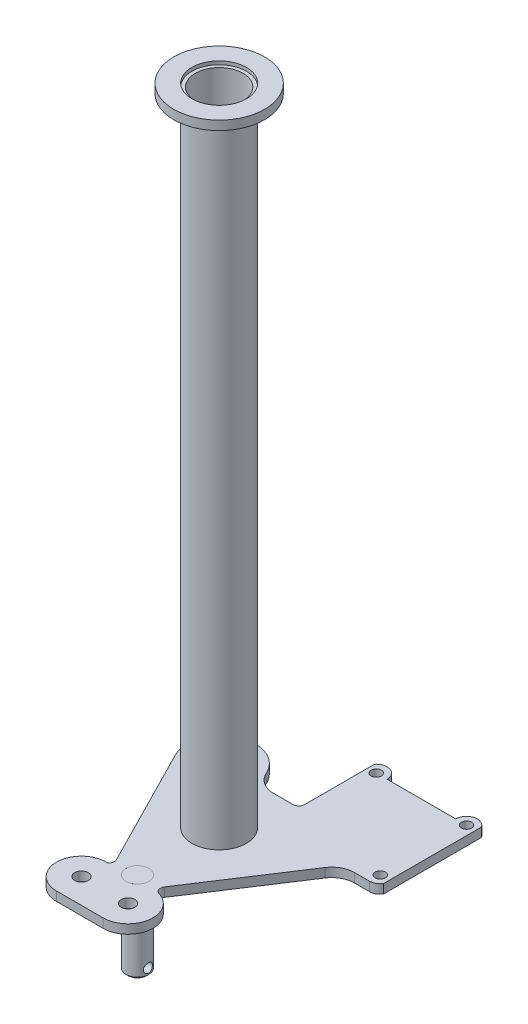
ISO-10303-21;
HEADER;
FILE_DESCRIPTION(('STEP AP214'),'2;1');
FILE_NAME('part.step','',(''),(''),'','','');
FILE_SCHEMA(('AUTOMOTIVE_DESIGN { 1 0 10303 214 1 1 1 1 }'));
ENDSEC;
DATA;
#1=APPLICATION_CONTEXT('core data for automotive mechanical design processes');
#2=APPLICATION_PROTOCOL_DEFINITION('international standard','automotive_design',2000,#1);
#3=PRODUCT_CONTEXT('',#1,'mechanical');
#4=PRODUCT('Part','Part','',(#3));
#5=PRODUCT_RELATED_PRODUCT_CATEGORY('part','',(#4));
#6=PRODUCT_DEFINITION_FORMATION('','',#4);
#7=PRODUCT_DEFINITION_CONTEXT('part definition',#1,'design');
#8=PRODUCT_DEFINITION('design','',#6,#7);
#9=PRODUCT_DEFINITION_SHAPE('','',#8);
#10=(LENGTH_UNIT() NAMED_UNIT(*) SI_UNIT(.MILLI.,.METRE.));
#11=(NAMED_UNIT(*) PLANE_ANGLE_UNIT() SI_UNIT($,.RADIAN.));
#12=(NAMED_UNIT(*) SI_UNIT($,.STERADIAN.) SOLID_ANGLE_UNIT());
#13=UNCERTAINTY_MEASURE_WITH_UNIT(LENGTH_MEASURE(1.E-05),#10,'distance_accuracy_value','');
#14=(GEOMETRIC_REPRESENTATION_CONTEXT(3) GLOBAL_UNCERTAINTY_ASSIGNED_CONTEXT((#13)) GLOBAL_UNIT_ASSIGNED_CONTEXT((#10,
#11,#12)) REPRESENTATION_CONTEXT('',''));
#15=CARTESIAN_POINT('',(0.,0.,0.));
#16=DIRECTION('',(0.,0.,1.));
#17=DIRECTION('',(1.,0.,0.));
#18=AXIS2_PLACEMENT_3D('',#15,#16,#17);
#19=CARTESIAN_POINT('',(0.,576.,0.));
#20=DIRECTION('',(0.,1.,0.));
#21=DIRECTION('',(0.,0.,1.));
#22=AXIS2_PLACEMENT_3D('',#19,#20,#21);
#23=PLANE('',#22);
#24=CARTESIAN_POINT('',(0.,576.,0.));
#25=DIRECTION('',(0.,1.,0.));
#26=DIRECTION('',(0.,0.,1.));
#27=AXIS2_PLACEMENT_3D('',#24,#25,#26);
#28=CIRCLE('',#27,40.);
#29=CARTESIAN_POINT('',(0.,576.,40.));
#30=VERTEX_POINT('',#29);
#31=EDGE_CURVE('E11',#30,#30,#28,.T.);
#32=ORIENTED_EDGE('',*,*,#31,.T.);
#33=EDGE_LOOP('',(#32));
#34=FACE_BOUND('',#33,.T.);
#35=CARTESIAN_POINT('',(0.,576.,0.));
#36=DIRECTION('',(0.,1.,0.));
#37=DIRECTION('',(0.,0.,1.));
#38=AXIS2_PLACEMENT_3D('',#35,#36,#37);
#39=CIRCLE('',#38,24.);
#40=CARTESIAN_POINT('',(0.,576.,24.));
#41=VERTEX_POINT('',#40);
#42=EDGE_CURVE('E52',#41,#41,#39,.T.);
#43=ORIENTED_EDGE('',*,*,#42,.F.);
#44=EDGE_LOOP('',(#43));
#45=FACE_BOUND('',#44,.T.);
#46=ADVANCED_FACE('F41',(#34,#45),#23,.T.);
#47=CARTESIAN_POINT('',(0.,568.,0.));
#48=DIRECTION('',(0.,1.,0.));
#49=DIRECTION('',(0.,0.,1.));
#50=AXIS2_PLACEMENT_3D('',#47,#48,#49);
#51=PLANE('',#50);
#52=CARTESIAN_POINT('',(0.,568.,0.));
#53=DIRECTION('',(0.,1.,0.));
#54=DIRECTION('',(0.,0.,1.));
#55=AXIS2_PLACEMENT_3D('',#52,#53,#54);
#56=CIRCLE('',#55,40.);
#57=CARTESIAN_POINT('',(0.,568.,40.));
#58=VERTEX_POINT('',#57);
#59=EDGE_CURVE('E48',#58,#58,#56,.T.);
#60=ORIENTED_EDGE('',*,*,#59,.F.);
#61=EDGE_LOOP('',(#60));
#62=FACE_BOUND('',#61,.T.);
#63=CARTESIAN_POINT('',(0.,568.,0.));
#64=DIRECTION('',(0.,1.,0.));
#65=DIRECTION('',(0.,0.,1.));
#66=AXIS2_PLACEMENT_3D('',#63,#64,#65);
#67=CIRCLE('',#66,24.);
#68=CARTESIAN_POINT('',(0.,568.,24.));
#69=VERTEX_POINT('',#68);
#70=EDGE_CURVE('E56',#69,#69,#67,.T.);
#71=ORIENTED_EDGE('',*,*,#70,.T.);
#72=EDGE_LOOP('',(#71));
#73=FACE_BOUND('',#72,.T.);
#74=ADVANCED_FACE('F62',(#62,#73),#51,.F.);
#75=CARTESIAN_POINT('',(0.,576.,0.));
#76=DIRECTION('',(0.,-1.,0.));
#77=DIRECTION('',(0.,0.,-1.));
#78=AXIS2_PLACEMENT_3D('',#75,#76,#77);
#79=CYLINDRICAL_SURFACE('',#78,40.);
#80=ORIENTED_EDGE('',*,*,#31,.F.);
#81=EDGE_LOOP('',(#80));
#82=FACE_BOUND('',#81,.T.);
#83=ORIENTED_EDGE('',*,*,#59,.T.);
#84=EDGE_LOOP('',(#83));
#85=FACE_BOUND('',#84,.T.);
#86=ADVANCED_FACE('F43',(#82,#85),#79,.T.);
#87=CARTESIAN_POINT('',(0.,576.,0.));
#88=DIRECTION('',(0.,-1.,0.));
#89=DIRECTION('',(0.,0.,-1.));
#90=AXIS2_PLACEMENT_3D('',#87,#88,#89);
#91=CYLINDRICAL_SURFACE('',#90,24.);
#92=ORIENTED_EDGE('',*,*,#42,.T.);
#93=EDGE_LOOP('',(#92));
#94=FACE_BOUND('',#93,.T.);
#95=ORIENTED_EDGE('',*,*,#70,.F.);
#96=EDGE_LOOP('',(#95));
#97=FACE_BOUND('',#96,.T.);
#98=ADVANCED_FACE('F64',(#94,#97),#91,.F.);
#99=CLOSED_SHELL('',(#46,#74,#86,#98));
#100=MANIFOLD_SOLID_BREP('B2',#99);
#101=CARTESIAN_POINT('',(0.,-65.,72.));
#102=DIRECTION('',(0.,1.,0.));
#103=DIRECTION('',(0.,0.,1.));
#104=AXIS2_PLACEMENT_3D('',#101,#102,#103);
#105=CYLINDRICAL_SURFACE('',#104,10.);
#106=CARTESIAN_POINT('',(-9.16515138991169,-58.,68.));
#107=CARTESIAN_POINT('',(-9.16515220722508,-57.8928225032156,68.0000008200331));
#108=CARTESIAN_POINT('',(-9.16703782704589,-57.7856121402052,68.0043137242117));
#109=CARTESIAN_POINT('',(-9.17451890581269,-57.5719679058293,68.0215219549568));
#110=CARTESIAN_POINT('',(-9.18011663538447,-57.4655345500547,68.034422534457));
#111=CARTESIAN_POINT('',(-9.19485078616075,-57.2540640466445,68.0687064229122));
#112=CARTESIAN_POINT('',(-9.20399425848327,-57.1490301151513,68.0901066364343));
#113=CARTESIAN_POINT('',(-9.22551446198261,-56.9413124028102,68.1411606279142));
#114=CARTESIAN_POINT('',(-9.23789253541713,-56.8386296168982,68.1708178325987));
#115=CARTESIAN_POINT('',(-9.27920231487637,-56.5360102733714,68.2715002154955));
#116=CARTESIAN_POINT('',(-9.31238810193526,-56.3404620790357,68.3544077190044));
#117=CARTESIAN_POINT('',(-9.38629512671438,-55.966198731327,68.5491674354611));
#118=CARTESIAN_POINT('',(-9.42701471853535,-55.7874799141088,68.661013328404));
#119=CARTESIAN_POINT('',(-9.51401677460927,-55.4414881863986,68.917353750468));
#120=CARTESIAN_POINT('',(-9.56047821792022,-55.275289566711,69.0632406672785));
#121=CARTESIAN_POINT('',(-9.65224928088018,-54.9689395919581,69.3805824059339));
#122=CARTESIAN_POINT('',(-9.69755849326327,-54.828797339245,69.5520461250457));
#123=CARTESIAN_POINT('',(-9.78406811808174,-54.5731878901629,69.92398720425));
#124=CARTESIAN_POINT('',(-9.82503606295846,-54.4589115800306,70.1253420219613));
#125=CARTESIAN_POINT('',(-9.89607856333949,-54.266312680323,70.5463494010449));
#126=CARTESIAN_POINT('',(-9.92615755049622,-54.1879754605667,70.7659944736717));
#127=CARTESIAN_POINT('',(-9.97076649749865,-54.073317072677,71.2060671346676));
#128=CARTESIAN_POINT('',(-9.98597873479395,-54.0351453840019,71.4259420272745));
#129=CARTESIAN_POINT('',(-10.001606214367,-53.9959430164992,71.8694673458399));
#130=CARTESIAN_POINT('',(-10.0020269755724,-53.9948984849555,72.0931163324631));
#131=CARTESIAN_POINT('',(-9.98843925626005,-54.0289655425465,72.5244649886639));
#132=CARTESIAN_POINT('',(-9.9752399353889,-54.0620495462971,72.7323549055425));
#133=CARTESIAN_POINT('',(-9.93698582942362,-54.1599857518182,73.1393462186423));
#134=CARTESIAN_POINT('',(-9.91193017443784,-54.2248402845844,73.338446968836));
#135=CARTESIAN_POINT('',(-9.85193648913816,-54.3852729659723,73.7257958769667));
#136=CARTESIAN_POINT('',(-9.81685520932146,-54.4812994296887,73.9138352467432));
#137=CARTESIAN_POINT('',(-9.74029170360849,-54.7009300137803,74.2716163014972));
#138=CARTESIAN_POINT('',(-9.69880728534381,-54.8245435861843,74.44135168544));
#139=CARTESIAN_POINT('',(-9.61043274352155,-55.1052982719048,74.7695376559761));
#140=CARTESIAN_POINT('',(-9.56336653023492,-55.2641077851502,74.9265156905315));
#141=CARTESIAN_POINT('',(-9.47123321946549,-55.6059811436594,75.2122148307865));
#142=CARTESIAN_POINT('',(-9.42616678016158,-55.78905289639,75.3409266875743));
#143=CARTESIAN_POINT('',(-9.34193794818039,-56.1808380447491,75.5698083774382));
#144=CARTESIAN_POINT('',(-9.30297828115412,-56.3901296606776,75.6690693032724));
#145=CARTESIAN_POINT('',(-9.23775180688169,-56.8244309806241,75.830352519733));
#146=CARTESIAN_POINT('',(-9.21147675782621,-57.0494303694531,75.892398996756));
#147=CARTESIAN_POINT('',(-9.1765951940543,-57.494071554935,75.9739098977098));
#148=CARTESIAN_POINT('',(-9.16700732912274,-57.7132008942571,75.9957441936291));
#149=CARTESIAN_POINT('',(-9.16378995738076,-58.1521544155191,76.0031226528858));
#150=CARTESIAN_POINT('',(-9.17015561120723,-58.3719783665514,75.9886778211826));
#151=CARTESIAN_POINT('',(-9.19712088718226,-58.7929178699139,75.9260657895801));
#152=CARTESIAN_POINT('',(-9.21688915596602,-58.9943858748,75.8798661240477));
#153=CARTESIAN_POINT('',(-9.26740102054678,-59.386576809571,75.7576083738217));
#154=CARTESIAN_POINT('',(-9.29814704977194,-59.5772973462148,75.6815436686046));
#155=CARTESIAN_POINT('',(-9.36867563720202,-59.9512047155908,75.4982712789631));
#156=CARTESIAN_POINT('',(-9.40877409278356,-60.1337723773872,75.3899257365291));
#157=CARTESIAN_POINT('',(-9.49300770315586,-60.478965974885,75.1463304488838));
#158=CARTESIAN_POINT('',(-9.53714449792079,-60.6415837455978,75.0110697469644));
#159=CARTESIAN_POINT('',(-9.62841831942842,-60.9547468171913,74.7056884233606));
#160=CARTESIAN_POINT('',(-9.67553614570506,-61.1035131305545,74.5337308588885));
#161=CARTESIAN_POINT('',(-9.76439589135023,-61.3703541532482,74.1661672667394));
#162=CARTESIAN_POINT('',(-9.8061375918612,-61.4884276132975,73.9705602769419));
#163=CARTESIAN_POINT('',(-9.87967431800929,-61.6900952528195,73.5605598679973));
#164=CARTESIAN_POINT('',(-9.9114717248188,-61.7736976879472,73.346170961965));
#165=CARTESIAN_POINT('',(-9.96145426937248,-61.9030977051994,72.9047871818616));
#166=CARTESIAN_POINT('',(-9.97964679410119,-61.9489158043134,72.6777992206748));
#167=CARTESIAN_POINT('',(-9.99958016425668,-61.999009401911,72.233633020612));
#168=CARTESIAN_POINT('',(-10.0023169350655,-62.0058002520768,72.0167809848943));
#169=CARTESIAN_POINT('',(-9.99372084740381,-61.9842890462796,71.5851323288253));
#170=CARTESIAN_POINT('',(-9.98239011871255,-61.9559923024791,71.3703354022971));
#171=CARTESIAN_POINT('',(-9.94743026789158,-61.8669064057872,70.9556581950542));
#172=CARTESIAN_POINT('',(-9.92418961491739,-61.807142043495,70.7555223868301));
#173=CARTESIAN_POINT('',(-9.86789895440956,-61.6578944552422,70.368155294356));
#174=CARTESIAN_POINT('',(-9.83484713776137,-61.568405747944,70.1809263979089));
#175=CARTESIAN_POINT('',(-9.76036189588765,-61.3577933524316,69.8155939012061));
#176=CARTESIAN_POINT('',(-9.71862262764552,-61.2354464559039,69.6382591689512));
#177=CARTESIAN_POINT('',(-9.63178803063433,-60.9644239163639,69.3058920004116));
#178=CARTESIAN_POINT('',(-9.58669131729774,-60.8157373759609,69.150868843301));
#179=CARTESIAN_POINT('',(-9.49475540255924,-60.4853657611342,68.8575972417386));
#180=CARTESIAN_POINT('',(-9.44798115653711,-60.302207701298,68.7209813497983));
#181=CARTESIAN_POINT('',(-9.3609929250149,-59.9141302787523,68.4803059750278));
#182=CARTESIAN_POINT('',(-9.32077971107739,-59.7092083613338,68.3762503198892));
#183=CARTESIAN_POINT('',(-9.2551790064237,-59.3018760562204,68.2120148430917));
#184=CARTESIAN_POINT('',(-9.22878451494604,-59.1008923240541,68.1487343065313));
#185=CARTESIAN_POINT('',(-9.19885565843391,-58.7933610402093,68.0780536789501));
#186=CARTESIAN_POINT('',(-9.19049270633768,-58.6899269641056,68.0585394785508));
#187=CARTESIAN_POINT('',(-9.17721200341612,-58.4816430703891,68.0277114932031));
#188=CARTESIAN_POINT('',(-9.17229225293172,-58.3767941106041,68.0163929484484));
#189=CARTESIAN_POINT('',(-9.16783675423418,-58.2264494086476,68.0061576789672));
#190=CARTESIAN_POINT('',(-9.16683059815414,-58.1812001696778,68.0038494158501));
#191=CARTESIAN_POINT('',(-9.16548771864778,-58.0906359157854,68.0007703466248));
#192=CARTESIAN_POINT('',(-9.16515104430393,-58.0453208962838,67.9999996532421));
#193=CARTESIAN_POINT('',(-9.16515138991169,-58.,68.));
#194=B_SPLINE_CURVE_WITH_KNOTS('',3,(#106,#107,#108,#109,#110,#111,#112,#113,#114,#115,#116,
#117,#118,#119,#120,#121,#122,#123,#124,#125,#126,#127,#128,#129,#130,#131,#132,#133,#134,#135,
#136,#137,#138,#139,#140,#141,#142,#143,#144,#145,#146,#147,#148,#149,#150,#151,#152,#153,#154,
#155,#156,#157,#158,#159,#160,#161,#162,#163,#164,#165,#166,#167,#168,#169,#170,#171,#172,#173,
#174,#175,#176,#177,#178,#179,#180,#181,#182,#183,#184,#185,#186,#187,#188,#189,#190,#191,#192,
#193),.UNSPECIFIED.,.T.,.F.,(4,2,2,2,2,2,2,2,2,2,2,2,2,2,2,2,2,2,2,2,2,2,2,2,2,2,2,2,2,2,2,2,2,
2,2,2,2,2,2,2,2,2,2,4),(0.,0.321486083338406,0.643168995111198,0.965494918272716,
1.28795480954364,1.92974178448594,2.57138871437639,3.24631250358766,3.92147162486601,
4.62325351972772,5.32474947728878,5.99228379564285,6.65956904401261,7.28937303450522,
7.91922324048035,8.55856614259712,9.19812843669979,9.87968101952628,10.5614562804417,
11.2624893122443,11.9630662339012,12.6208430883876,13.278420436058,13.8985450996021,
14.5188073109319,15.1642232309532,15.8099024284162,16.5032748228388,17.1966754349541,
17.8899098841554,18.5827676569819,19.2304209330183,19.8779761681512,20.5056400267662,
21.1334196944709,21.7889411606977,22.4447344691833,23.1411252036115,23.837597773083,
24.4715333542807,24.7879924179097,25.104267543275,25.240200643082,25.3761437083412),.UNSPECIFIED.);
#195=CARTESIAN_POINT('',(-9.16515138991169,-58.,68.));
#196=VERTEX_POINT('',#195);
#197=EDGE_CURVE('E114',#196,#196,#194,.T.);
#198=ORIENTED_EDGE('',*,*,#197,.T.);
#199=EDGE_LOOP('',(#198));
#200=FACE_BOUND('',#199,.T.);
#201=CARTESIAN_POINT('',(9.16515138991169,-58.,68.));
#202=CARTESIAN_POINT('',(9.16515220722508,-58.1071774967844,68.0000008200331));
#203=CARTESIAN_POINT('',(9.16703782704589,-58.2143878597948,68.0043137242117));
#204=CARTESIAN_POINT('',(9.17451890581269,-58.4280320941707,68.0215219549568));
#205=CARTESIAN_POINT('',(9.18011663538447,-58.5344654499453,68.034422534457));
#206=CARTESIAN_POINT('',(9.19485078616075,-58.7459359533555,68.0687064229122));
#207=CARTESIAN_POINT('',(9.20399425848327,-58.8509698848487,68.0901066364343));
#208=CARTESIAN_POINT('',(9.22551446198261,-59.0586875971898,68.1411606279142));
#209=CARTESIAN_POINT('',(9.23789253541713,-59.1613703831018,68.1708178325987));
#210=CARTESIAN_POINT('',(9.27920231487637,-59.4639897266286,68.2715002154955));
#211=CARTESIAN_POINT('',(9.31238810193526,-59.6595379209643,68.3544077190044));
#212=CARTESIAN_POINT('',(9.38629512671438,-60.033801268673,68.5491674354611));
#213=CARTESIAN_POINT('',(9.42701471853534,-60.2125200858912,68.661013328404));
#214=CARTESIAN_POINT('',(9.51401677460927,-60.5585118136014,68.917353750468));
#215=CARTESIAN_POINT('',(9.56047821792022,-60.724710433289,69.0632406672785));
#216=CARTESIAN_POINT('',(9.65224928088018,-61.0310604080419,69.3805824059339));
#217=CARTESIAN_POINT('',(9.69755849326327,-61.171202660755,69.5520461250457));
#218=CARTESIAN_POINT('',(9.78406811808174,-61.4268121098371,69.92398720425));
#219=CARTESIAN_POINT('',(9.82503606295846,-61.5410884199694,70.1253420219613));
#220=CARTESIAN_POINT('',(9.89607856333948,-61.733687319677,70.5463494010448));
#221=CARTESIAN_POINT('',(9.92615755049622,-61.8120245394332,70.7659944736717));
#222=CARTESIAN_POINT('',(9.97076649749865,-61.926682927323,71.2060671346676));
#223=CARTESIAN_POINT('',(9.98597873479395,-61.9648546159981,71.4259420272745));
#224=CARTESIAN_POINT('',(10.001606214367,-62.0040569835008,71.8694673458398));
#225=CARTESIAN_POINT('',(10.0020269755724,-62.0051015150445,72.0931163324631));
#226=CARTESIAN_POINT('',(9.98843925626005,-61.9710344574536,72.5244649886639));
#227=CARTESIAN_POINT('',(9.9752399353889,-61.9379504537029,72.7323549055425));
#228=CARTESIAN_POINT('',(9.93698582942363,-61.8400142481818,73.1393462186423));
#229=CARTESIAN_POINT('',(9.91193017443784,-61.7751597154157,73.338446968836));
#230=CARTESIAN_POINT('',(9.85193648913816,-61.6147270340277,73.7257958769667));
#231=CARTESIAN_POINT('',(9.81685520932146,-61.5187005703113,73.9138352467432));
#232=CARTESIAN_POINT('',(9.74029170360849,-61.2990699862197,74.2716163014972));
#233=CARTESIAN_POINT('',(9.69880728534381,-61.1754564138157,74.4413516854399));
#234=CARTESIAN_POINT('',(9.61043274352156,-60.8947017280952,74.7695376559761));
#235=CARTESIAN_POINT('',(9.56336653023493,-60.7358922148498,74.9265156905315));
#236=CARTESIAN_POINT('',(9.47123321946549,-60.3940188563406,75.2122148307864));
#237=CARTESIAN_POINT('',(9.42616678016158,-60.2109471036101,75.3409266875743));
#238=CARTESIAN_POINT('',(9.34193794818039,-59.8191619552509,75.5698083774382));
#239=CARTESIAN_POINT('',(9.30297828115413,-59.6098703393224,75.6690693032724));
#240=CARTESIAN_POINT('',(9.2377518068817,-59.1755690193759,75.830352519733));
#241=CARTESIAN_POINT('',(9.21147675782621,-58.9505696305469,75.892398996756));
#242=CARTESIAN_POINT('',(9.1765951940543,-58.5059284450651,75.9739098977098));
#243=CARTESIAN_POINT('',(9.16700732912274,-58.2867991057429,75.9957441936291));
#244=CARTESIAN_POINT('',(9.16378995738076,-57.8478455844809,76.0031226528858));
#245=CARTESIAN_POINT('',(9.17015561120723,-57.6280216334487,75.9886778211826));
#246=CARTESIAN_POINT('',(9.19712088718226,-57.2070821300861,75.9260657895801));
#247=CARTESIAN_POINT('',(9.21688915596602,-57.0056141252,75.8798661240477));
#248=CARTESIAN_POINT('',(9.26740102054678,-56.613423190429,75.7576083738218));
#249=CARTESIAN_POINT('',(9.29814704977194,-56.4227026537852,75.6815436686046));
#250=CARTESIAN_POINT('',(9.36867563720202,-56.0487952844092,75.4982712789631));
#251=CARTESIAN_POINT('',(9.40877409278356,-55.8662276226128,75.3899257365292));
#252=CARTESIAN_POINT('',(9.49300770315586,-55.521034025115,75.1463304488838));
#253=CARTESIAN_POINT('',(9.53714449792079,-55.3584162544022,75.0110697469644));
#254=CARTESIAN_POINT('',(9.62841831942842,-55.0452531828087,74.7056884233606));
#255=CARTESIAN_POINT('',(9.67553614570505,-54.8964868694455,74.5337308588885));
#256=CARTESIAN_POINT('',(9.76439589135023,-54.6296458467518,74.1661672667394));
#257=CARTESIAN_POINT('',(9.8061375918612,-54.5115723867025,73.9705602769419));
#258=CARTESIAN_POINT('',(9.87967431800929,-54.3099047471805,73.5605598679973));
#259=CARTESIAN_POINT('',(9.9114717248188,-54.2263023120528,73.346170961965));
#260=CARTESIAN_POINT('',(9.96145426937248,-54.0969022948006,72.9047871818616));
#261=CARTESIAN_POINT('',(9.97964679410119,-54.0510841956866,72.6777992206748));
#262=CARTESIAN_POINT('',(9.99958016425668,-54.000990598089,72.233633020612));
#263=CARTESIAN_POINT('',(10.0023169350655,-53.9941997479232,72.0167809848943));
#264=CARTESIAN_POINT('',(9.99372084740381,-54.0157109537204,71.5851323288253));
#265=CARTESIAN_POINT('',(9.98239011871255,-54.0440076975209,71.3703354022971));
#266=CARTESIAN_POINT('',(9.94743026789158,-54.1330935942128,70.9556581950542));
#267=CARTESIAN_POINT('',(9.92418961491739,-54.192857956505,70.7555223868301));
#268=CARTESIAN_POINT('',(9.86789895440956,-54.3421055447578,70.368155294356));
#269=CARTESIAN_POINT('',(9.83484713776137,-54.431594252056,70.1809263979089));
#270=CARTESIAN_POINT('',(9.76036189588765,-54.6422066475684,69.8155939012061));
#271=CARTESIAN_POINT('',(9.71862262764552,-54.7645535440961,69.6382591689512));
#272=CARTESIAN_POINT('',(9.63178803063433,-55.0355760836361,69.3058920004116));
#273=CARTESIAN_POINT('',(9.58669131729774,-55.1842626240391,69.150868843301));
#274=CARTESIAN_POINT('',(9.49475540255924,-55.5146342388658,68.8575972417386));
#275=CARTESIAN_POINT('',(9.44798115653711,-55.697792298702,68.7209813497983));
#276=CARTESIAN_POINT('',(9.36099292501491,-56.0858697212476,68.4803059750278));
#277=CARTESIAN_POINT('',(9.32077971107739,-56.2907916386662,68.3762503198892));
#278=CARTESIAN_POINT('',(9.2551790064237,-56.6981239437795,68.2120148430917));
#279=CARTESIAN_POINT('',(9.22878451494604,-56.8991076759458,68.1487343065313));
#280=CARTESIAN_POINT('',(9.19885565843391,-57.2066389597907,68.0780536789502));
#281=CARTESIAN_POINT('',(9.19049270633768,-57.3100730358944,68.0585394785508));
#282=CARTESIAN_POINT('',(9.17721200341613,-57.5183569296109,68.0277114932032));
#283=CARTESIAN_POINT('',(9.17229225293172,-57.6232058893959,68.0163929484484));
#284=CARTESIAN_POINT('',(9.16783675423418,-57.7735505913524,68.0061576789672));
#285=CARTESIAN_POINT('',(9.16683059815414,-57.8187998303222,68.0038494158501));
#286=CARTESIAN_POINT('',(9.16548771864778,-57.9093640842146,68.0007703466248));
#287=CARTESIAN_POINT('',(9.16515104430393,-57.9546791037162,67.9999996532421));
#288=CARTESIAN_POINT('',(9.16515138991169,-58.,68.));
#289=B_SPLINE_CURVE_WITH_KNOTS('',3,(#201,#202,#203,#204,#205,#206,#207,#208,#209,#210,#211,
#212,#213,#214,#215,#216,#217,#218,#219,#220,#221,#222,#223,#224,#225,#226,#227,#228,#229,#230,
#231,#232,#233,#234,#235,#236,#237,#238,#239,#240,#241,#242,#243,#244,#245,#246,#247,#248,#249,
#250,#251,#252,#253,#254,#255,#256,#257,#258,#259,#260,#261,#262,#263,#264,#265,#266,#267,#268,
#269,#270,#271,#272,#273,#274,#275,#276,#277,#278,#279,#280,#281,#282,#283,#284,#285,#286,#287,
#288),.UNSPECIFIED.,.T.,.F.,(4,2,2,2,2,2,2,2,2,2,2,2,2,2,2,2,2,2,2,2,2,2,2,2,2,2,2,2,2,2,2,2,2,
2,2,2,2,2,2,2,2,2,2,4),(0.,0.321486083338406,0.643168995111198,0.965494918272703,
1.28795480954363,1.92974178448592,2.57138871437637,3.24631250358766,3.921471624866,
4.62325351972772,5.32474947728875,5.99228379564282,6.6595690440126,7.28937303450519,
7.91922324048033,8.55856614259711,9.19812843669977,9.87968101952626,10.5614562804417,
11.2624893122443,11.9630662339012,12.6208430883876,13.278420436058,13.8985450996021,
14.5188073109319,15.1642232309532,15.8099024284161,16.5032748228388,17.1966754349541,
17.8899098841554,18.5827676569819,19.2304209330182,19.8779761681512,20.5056400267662,
21.1334196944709,21.7889411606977,22.4447344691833,23.1411252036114,23.8375977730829,
24.4715333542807,24.7879924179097,25.1042675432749,25.240200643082,25.3761437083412),.UNSPECIFIED.);
#290=CARTESIAN_POINT('',(9.16515138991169,-58.,68.));
#291=VERTEX_POINT('',#290);
#292=EDGE_CURVE('E129',#291,#291,#289,.T.);
#293=ORIENTED_EDGE('',*,*,#292,.T.);
#294=EDGE_LOOP('',(#293));
#295=FACE_BOUND('',#294,.T.);
#296=CARTESIAN_POINT('',(0.,-63.,72.));
#297=DIRECTION('',(0.,-1.,0.));
#298=DIRECTION('',(0.,0.,-1.));
#299=AXIS2_PLACEMENT_3D('',#296,#297,#298);
#300=CIRCLE('',#299,10.);
#301=CARTESIAN_POINT('',(0.,-63.,62.));
#302=VERTEX_POINT('',#301);
#303=EDGE_CURVE('E40',#302,#302,#300,.F.);
#304=ORIENTED_EDGE('',*,*,#303,.T.);
#305=EDGE_LOOP('',(#304));
#306=FACE_BOUND('',#305,.T.);
#307=CARTESIAN_POINT('',(0.,8.,72.));
#308=DIRECTION('',(0.,-1.,0.));
#309=DIRECTION('',(0.,0.,-1.));
#310=AXIS2_PLACEMENT_3D('',#307,#308,#309);
#311=CIRCLE('',#310,10.);
#312=CARTESIAN_POINT('',(0.,8.,62.));
#313=VERTEX_POINT('',#312);
#314=EDGE_CURVE('E126',#313,#313,#311,.T.);
#315=ORIENTED_EDGE('',*,*,#314,.T.);
#316=EDGE_LOOP('',(#315));
#317=FACE_BOUND('',#316,.T.);
#318=ADVANCED_FACE('F110',(#200,#295,#306,#317),#105,.T.);
#319=CARTESIAN_POINT('',(0.,-65.,72.));
#320=DIRECTION('',(0.,-1.,0.));
#321=DIRECTION('',(0.,0.,-1.));
#322=AXIS2_PLACEMENT_3D('',#319,#320,#321);
#323=PLANE('',#322);
#324=CARTESIAN_POINT('',(0.,-65.,72.));
#325=DIRECTION('',(0.,-1.,0.));
#326=DIRECTION('',(0.,0.,-1.));
#327=AXIS2_PLACEMENT_3D('',#324,#325,#326);
#328=CIRCLE('',#327,7.99999999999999);
#329=CARTESIAN_POINT('',(0.,-65.,64.));
#330=VERTEX_POINT('',#329);
#331=EDGE_CURVE('E121',#330,#330,#328,.T.);
#332=ORIENTED_EDGE('',*,*,#331,.T.);
#333=EDGE_LOOP('',(#332));
#334=FACE_BOUND('',#333,.T.);
#335=ADVANCED_FACE('F145',(#334),#323,.T.);
#336=CARTESIAN_POINT('',(0.,8.,72.));
#337=DIRECTION('',(0.,-1.,0.));
#338=DIRECTION('',(0.,0.,-1.));
#339=AXIS2_PLACEMENT_3D('',#336,#337,#338);
#340=PLANE('',#339);
#341=ORIENTED_EDGE('',*,*,#314,.F.);
#342=EDGE_LOOP('',(#341));
#343=FACE_BOUND('',#342,.T.);
#344=ADVANCED_FACE('F142',(#343),#340,.F.);
#345=CARTESIAN_POINT('',(0.,-65.,72.));
#346=DIRECTION('',(0.,1.,0.));
#347=DIRECTION('',(0.,0.,1.));
#348=AXIS2_PLACEMENT_3D('',#345,#346,#347);
#349=CONICAL_SURFACE('',#348,7.99999999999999,0.785398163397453);
#350=ORIENTED_EDGE('',*,*,#303,.F.);
#351=EDGE_LOOP('',(#350));
#352=FACE_BOUND('',#351,.T.);
#353=ORIENTED_EDGE('',*,*,#331,.F.);
#354=EDGE_LOOP('',(#353));
#355=FACE_BOUND('',#354,.T.);
#356=ADVANCED_FACE('F137',(#352,#355),#349,.T.);
#357=CARTESIAN_POINT('',(-78.1,-58.,72.));
#358=DIRECTION('',(1.,0.,0.));
#359=DIRECTION('',(0.,0.,-1.));
#360=AXIS2_PLACEMENT_3D('',#357,#358,#359);
#361=CYLINDRICAL_SURFACE('',#360,4.00000000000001);
#362=ORIENTED_EDGE('',*,*,#292,.F.);
#363=EDGE_LOOP('',(#362));
#364=FACE_BOUND('',#363,.T.);
#365=ORIENTED_EDGE('',*,*,#197,.F.);
#366=EDGE_LOOP('',(#365));
#367=FACE_BOUND('',#366,.T.);
#368=ADVANCED_FACE('F133',(#364,#367),#361,.F.);
#369=CLOSED_SHELL('',(#318,#335,#344,#356,#368));
#370=MANIFOLD_SOLID_BREP('B6',#369);
#371=CARTESIAN_POINT('',(0.,573.,0.));
#372=DIRECTION('',(0.,-1.,0.));
#373=DIRECTION('',(0.,0.,-1.));
#374=AXIS2_PLACEMENT_3D('',#371,#372,#373);
#375=CYLINDRICAL_SURFACE('',#374,21.);
#376=CARTESIAN_POINT('',(0.,573.,0.));
#377=DIRECTION('',(0.,1.,0.));
#378=DIRECTION('',(0.,0.,1.));
#379=AXIS2_PLACEMENT_3D('',#376,#377,#378);
#380=CIRCLE('',#379,21.);
#381=CARTESIAN_POINT('',(0.,573.,21.));
#382=VERTEX_POINT('',#381);
#383=EDGE_CURVE('E215',#382,#382,#380,.T.);
#384=ORIENTED_EDGE('',*,*,#383,.T.);
#385=EDGE_LOOP('',(#384));
#386=FACE_BOUND('',#385,.T.);
#387=CARTESIAN_POINT('',(0.,-5.,0.));
#388=DIRECTION('',(0.,1.,0.));
#389=DIRECTION('',(0.,0.,1.));
#390=AXIS2_PLACEMENT_3D('',#387,#388,#389);
#391=CIRCLE('',#390,21.);
#392=CARTESIAN_POINT('',(0.,-5.,21.));
#393=VERTEX_POINT('',#392);
#394=EDGE_CURVE('E223',#393,#393,#391,.T.);
#395=ORIENTED_EDGE('',*,*,#394,.F.);
#396=EDGE_LOOP('',(#395));
#397=FACE_BOUND('',#396,.T.);
#398=ADVANCED_FACE('F209',(#386,#397),#375,.F.);
#399=CARTESIAN_POINT('',(0.,573.,0.));
#400=DIRECTION('',(0.,-1.,0.));
#401=DIRECTION('',(0.,0.,-1.));
#402=AXIS2_PLACEMENT_3D('',#399,#400,#401);
#403=CYLINDRICAL_SURFACE('',#402,24.);
#404=CARTESIAN_POINT('',(0.,573.,0.));
#405=DIRECTION('',(0.,1.,0.));
#406=DIRECTION('',(0.,0.,1.));
#407=AXIS2_PLACEMENT_3D('',#404,#405,#406);
#408=CIRCLE('',#407,24.);
#409=CARTESIAN_POINT('',(0.,573.,24.));
#410=VERTEX_POINT('',#409);
#411=EDGE_CURVE('E109',#410,#410,#408,.T.);
#412=ORIENTED_EDGE('',*,*,#411,.F.);
#413=EDGE_LOOP('',(#412));
#414=FACE_BOUND('',#413,.T.);
#415=CARTESIAN_POINT('',(0.,-5.,0.));
#416=DIRECTION('',(0.,1.,0.));
#417=DIRECTION('',(0.,0.,1.));
#418=AXIS2_PLACEMENT_3D('',#415,#416,#417);
#419=CIRCLE('',#418,24.);
#420=CARTESIAN_POINT('',(0.,-5.,24.));
#421=VERTEX_POINT('',#420);
#422=EDGE_CURVE('E219',#421,#421,#419,.T.);
#423=ORIENTED_EDGE('',*,*,#422,.T.);
#424=EDGE_LOOP('',(#423));
#425=FACE_BOUND('',#424,.T.);
#426=ADVANCED_FACE('F233',(#414,#425),#403,.T.);
#427=CARTESIAN_POINT('',(0.,573.,0.));
#428=DIRECTION('',(0.,1.,0.));
#429=DIRECTION('',(0.,0.,1.));
#430=AXIS2_PLACEMENT_3D('',#427,#428,#429);
#431=PLANE('',#430);
#432=ORIENTED_EDGE('',*,*,#383,.F.);
#433=EDGE_LOOP('',(#432));
#434=FACE_BOUND('',#433,.T.);
#435=ORIENTED_EDGE('',*,*,#411,.T.);
#436=EDGE_LOOP('',(#435));
#437=FACE_BOUND('',#436,.T.);
#438=ADVANCED_FACE('F237',(#434,#437),#431,.T.);
#439=CARTESIAN_POINT('',(0.,-5.,0.));
#440=DIRECTION('',(0.,1.,0.));
#441=DIRECTION('',(0.,0.,1.));
#442=AXIS2_PLACEMENT_3D('',#439,#440,#441);
#443=PLANE('',#442);
#444=ORIENTED_EDGE('',*,*,#394,.T.);
#445=EDGE_LOOP('',(#444));
#446=FACE_BOUND('',#445,.T.);
#447=ORIENTED_EDGE('',*,*,#422,.F.);
#448=EDGE_LOOP('',(#447));
#449=FACE_BOUND('',#448,.T.);
#450=ADVANCED_FACE('F229',(#446,#449),#443,.F.);
#451=CLOSED_SHELL('',(#398,#426,#438,#450));
#452=MANIFOLD_SOLID_BREP('B35',#451);
#453=CARTESIAN_POINT('',(-25.25,8.,72.));
#454=DIRECTION('',(0.,1.,0.));
#455=DIRECTION('',(0.,0.,1.));
#456=AXIS2_PLACEMENT_3D('',#453,#454,#455);
#457=PLANE('',#456);
#458=CARTESIAN_POINT('',(107.,8.,-34.9));
#459=DIRECTION('',(0.,1.,0.));
#460=DIRECTION('',(0.,0.,1.));
#461=AXIS2_PLACEMENT_3D('',#458,#459,#460);
#462=CIRCLE('',#461,4.50000000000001);
#463=CARTESIAN_POINT('',(107.,8.,-30.4));
#464=VERTEX_POINT('',#463);
#465=EDGE_CURVE('E694',#464,#464,#462,.T.);
#466=ORIENTED_EDGE('',*,*,#465,.F.);
#467=EDGE_LOOP('',(#466));
#468=FACE_BOUND('',#467,.T.);
#469=CARTESIAN_POINT('',(17.6217629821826,8.,97.9));
#470=DIRECTION('',(0.,1.,0.));
#471=DIRECTION('',(0.,0.,1.));
#472=AXIS2_PLACEMENT_3D('',#469,#470,#471);
#473=CIRCLE('',#472,6.00000000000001);
#474=CARTESIAN_POINT('',(17.6217629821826,8.,103.9));
#475=VERTEX_POINT('',#474);
#476=EDGE_CURVE('E706',#475,#475,#473,.T.);
#477=ORIENTED_EDGE('',*,*,#476,.F.);
#478=EDGE_LOOP('',(#477));
#479=FACE_BOUND('',#478,.T.);
#480=CARTESIAN_POINT('',(0.,8.,72.));
#481=DIRECTION('',(0.,1.,0.));
#482=DIRECTION('',(0.,0.,1.));
#483=AXIS2_PLACEMENT_3D('',#480,#481,#482);
#484=CIRCLE('',#483,10.);
#485=CARTESIAN_POINT('',(0.,8.,82.));
#486=VERTEX_POINT('',#485);
#487=EDGE_CURVE('E718',#486,#486,#484,.T.);
#488=ORIENTED_EDGE('',*,*,#487,.F.);
#489=EDGE_LOOP('',(#488));
#490=FACE_BOUND('',#489,.T.);
#491=CARTESIAN_POINT('',(0.,8.,0.));
#492=DIRECTION('',(0.,1.,0.));
#493=DIRECTION('',(0.,0.,1.));
#494=AXIS2_PLACEMENT_3D('',#491,#492,#493);
#495=CIRCLE('',#494,24.);
#496=CARTESIAN_POINT('',(0.,8.,24.));
#497=VERTEX_POINT('',#496);
#498=EDGE_CURVE('E428',#497,#497,#495,.T.);
#499=ORIENTED_EDGE('',*,*,#498,.F.);
#500=EDGE_LOOP('',(#499));
#501=FACE_BOUND('',#500,.T.);
#502=CARTESIAN_POINT('',(-25.25,8.,72.));
#503=DIRECTION('',(0.,-1.,0.));
#504=DIRECTION('',(0.,0.,1.));
#505=AXIS2_PLACEMENT_3D('',#502,#503,#504);
#506=CIRCLE('',#505,5.);
#507=CARTESIAN_POINT('',(-20.7953119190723,8.,69.7293714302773));
#508=VERTEX_POINT('',#507);
#509=CARTESIAN_POINT('',(-22.1634076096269,8.,75.9335667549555));
#510=VERTEX_POINT('',#509);
#511=EDGE_CURVE('E468',#508,#510,#506,.T.);
#512=ORIENTED_EDGE('',*,*,#511,.T.);
#513=CARTESIAN_POINT('',(-23.3782370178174,8.,97.9));
#514=DIRECTION('',(0.,1.,0.));
#515=DIRECTION('',(0.,0.,-1.));
#516=AXIS2_PLACEMENT_3D('',#513,#514,#515);
#517=CIRCLE('',#516,22.);
#518=CARTESIAN_POINT('',(-23.3782370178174,8.,119.9));
#519=VERTEX_POINT('',#518);
#520=EDGE_CURVE('E423',#510,#519,#517,.T.);
#521=ORIENTED_EDGE('',*,*,#520,.T.);
#522=DIRECTION('',(1.,0.,0.));
#523=VECTOR('',#522,1.);
#524=CARTESIAN_POINT('',(17.6217629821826,8.,119.9));
#525=LINE('',#524,#523);
#526=CARTESIAN_POINT('',(17.6217629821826,8.,119.9));
#527=VERTEX_POINT('',#526);
#528=EDGE_CURVE('E471',#519,#527,#525,.T.);
#529=ORIENTED_EDGE('',*,*,#528,.T.);
#530=CARTESIAN_POINT('',(17.6217629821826,8.,97.9));
#531=DIRECTION('',(0.,1.,0.));
#532=DIRECTION('',(0.,0.,-1.));
#533=AXIS2_PLACEMENT_3D('',#530,#531,#532);
#534=CIRCLE('',#533,22.);
#535=CARTESIAN_POINT('',(23.837363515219,8.,76.7962962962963));
#536=VERTEX_POINT('',#535);
#537=EDGE_CURVE('E473',#527,#536,#534,.T.);
#538=ORIENTED_EDGE('',*,*,#537,.T.);
#539=CARTESIAN_POINT('',(25.25,8.,72.));
#540=DIRECTION('',(0.,-1.,0.));
#541=DIRECTION('',(0.,0.,1.));
#542=AXIS2_PLACEMENT_3D('',#539,#540,#541);
#543=CIRCLE('',#542,5.);
#544=CARTESIAN_POINT('',(21.0656809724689,8.,69.2629442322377));
#545=VERTEX_POINT('',#544);
#546=EDGE_CURVE('E475',#536,#545,#543,.T.);
#547=ORIENTED_EDGE('',*,*,#546,.T.);
#548=DIRECTION('',(0.547411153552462,0.,-0.836863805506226));
#549=VECTOR('',#548,1.);
#550=CARTESIAN_POINT('',(77.0658419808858,8.,-16.3482230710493));
#551=LINE('',#550,#549);
#552=CARTESIAN_POINT('',(77.0658419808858,8.,-16.3482230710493));
#553=VERTEX_POINT('',#552);
#554=EDGE_CURVE('E477',#545,#553,#551,.T.);
#555=ORIENTED_EDGE('',*,*,#554,.T.);
#556=CARTESIAN_POINT('',(93.8031180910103,8.,-5.40000000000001));
#557=DIRECTION('',(0.,-1.,0.));
#558=DIRECTION('',(0.,0.,1.));
#559=AXIS2_PLACEMENT_3D('',#556,#557,#558);
#560=CIRCLE('',#559,20.);
#561=CARTESIAN_POINT('',(93.8031180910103,8.,-25.4));
#562=VERTEX_POINT('',#561);
#563=EDGE_CURVE('E479',#553,#562,#560,.T.);
#564=ORIENTED_EDGE('',*,*,#563,.T.);
#565=DIRECTION('',(1.,0.,0.));
#566=VECTOR('',#565,1.);
#567=CARTESIAN_POINT('',(107.,8.,-25.4));
#568=LINE('',#567,#566);
#569=CARTESIAN_POINT('',(107.,8.,-25.4));
#570=VERTEX_POINT('',#569);
#571=EDGE_CURVE('E481',#562,#570,#568,.T.);
#572=ORIENTED_EDGE('',*,*,#571,.T.);
#573=CARTESIAN_POINT('',(107.,8.,-34.9));
#574=DIRECTION('',(0.,1.,0.));
#575=DIRECTION('',(0.,0.,-1.));
#576=AXIS2_PLACEMENT_3D('',#573,#574,#575);
#577=CIRCLE('',#576,9.5);
#578=CARTESIAN_POINT('',(115.,8.,-29.7765246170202));
#579=VERTEX_POINT('',#578);
#580=EDGE_CURVE('E483',#570,#579,#577,.T.);
#581=ORIENTED_EDGE('',*,*,#580,.T.);
#582=DIRECTION('',(0.,0.,-1.));
#583=VECTOR('',#582,1.);
#584=CARTESIAN_POINT('',(115.,8.,-116.02347538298));
#585=LINE('',#584,#583);
#586=CARTESIAN_POINT('',(115.,8.,-116.02347538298));
#587=VERTEX_POINT('',#586);
#588=EDGE_CURVE('E485',#579,#587,#585,.T.);
#589=ORIENTED_EDGE('',*,*,#588,.T.);
#590=CARTESIAN_POINT('',(107.,8.,-110.9));
#591=DIRECTION('',(0.,1.,0.));
#592=DIRECTION('',(0.,0.,-1.));
#593=AXIS2_PLACEMENT_3D('',#590,#591,#592);
#594=CIRCLE('',#593,9.5);
#595=CARTESIAN_POINT('',(97.5,8.,-110.9));
#596=VERTEX_POINT('',#595);
#597=EDGE_CURVE('E487',#587,#596,#594,.T.);
#598=ORIENTED_EDGE('',*,*,#597,.T.);
#599=DIRECTION('',(-1.,0.,0.));
#600=VECTOR('',#599,1.);
#601=CARTESIAN_POINT('',(37.,8.,-110.9));
#602=LINE('',#601,#600);
#603=CARTESIAN_POINT('',(37.,8.,-110.9));
#604=VERTEX_POINT('',#603);
#605=EDGE_CURVE('E489',#596,#604,#602,.T.);
#606=ORIENTED_EDGE('',*,*,#605,.T.);
#607=CARTESIAN_POINT('',(27.5,8.,-110.9));
#608=DIRECTION('',(0.,1.,0.));
#609=DIRECTION('',(0.,0.,-1.));
#610=AXIS2_PLACEMENT_3D('',#607,#608,#609);
#611=CIRCLE('',#610,9.5);
#612=CARTESIAN_POINT('',(20.,8.,-116.730951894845));
#613=VERTEX_POINT('',#612);
#614=EDGE_CURVE('E491',#604,#613,#611,.T.);
#615=ORIENTED_EDGE('',*,*,#614,.T.);
#616=DIRECTION('',(0.,0.,1.));
#617=VECTOR('',#616,1.);
#618=CARTESIAN_POINT('',(20.,8.,-55.1857092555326));
#619=LINE('',#618,#617);
#620=CARTESIAN_POINT('',(20.,8.,-55.1857092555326));
#621=VERTEX_POINT('',#620);
#622=EDGE_CURVE('E493',#613,#621,#619,.T.);
#623=ORIENTED_EDGE('',*,*,#622,.T.);
#624=CARTESIAN_POINT('',(15.,8.,-55.1857092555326));
#625=DIRECTION('',(0.,-1.,0.));
#626=DIRECTION('',(0.,0.,1.));
#627=AXIS2_PLACEMENT_3D('',#624,#625,#626);
#628=CIRCLE('',#627,5.);
#629=CARTESIAN_POINT('',(15.,8.,-50.1857092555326));
#630=VERTEX_POINT('',#629);
#631=EDGE_CURVE('E495',#621,#630,#628,.T.);
#632=ORIENTED_EDGE('',*,*,#631,.T.);
#633=DIRECTION('',(-1.,0.,0.));
#634=VECTOR('',#633,1.);
#635=CARTESIAN_POINT('',(-2.4,8.,-50.1857092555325));
#636=LINE('',#635,#634);
#637=CARTESIAN_POINT('',(-2.39999999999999,8.,-50.1857092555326));
#638=VERTEX_POINT('',#637);
#639=EDGE_CURVE('E497',#630,#638,#636,.T.);
#640=ORIENTED_EDGE('',*,*,#639,.T.);
#641=CARTESIAN_POINT('',(-2.4,8.,-70.1857092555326));
#642=DIRECTION('',(0.,-1.,0.));
#643=DIRECTION('',(0.,0.,-1.));
#644=AXIS2_PLACEMENT_3D('',#641,#642,#643);
#645=CIRCLE('',#644,20.);
#646=CARTESIAN_POINT('',(-20.68,8.,-62.0714255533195));
#647=VERTEX_POINT('',#646);
#648=EDGE_CURVE('E499',#638,#647,#645,.T.);
#649=ORIENTED_EDGE('',*,*,#648,.T.);
#650=CARTESIAN_POINT('',(-48.1,8.,-49.9));
#651=DIRECTION('',(0.,1.,0.));
#652=DIRECTION('',(0.,0.,-1.));
#653=AXIS2_PLACEMENT_3D('',#650,#651,#652);
#654=CIRCLE('',#653,30.);
#655=CARTESIAN_POINT('',(-74.828128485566,8.,-36.2762285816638));
#656=VERTEX_POINT('',#655);
#657=EDGE_CURVE('E298',#647,#656,#654,.T.);
#658=ORIENTED_EDGE('',*,*,#657,.T.);
#659=DIRECTION('',(0.45412571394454,0.,0.890937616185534));
#660=VECTOR('',#659,1.);
#661=CARTESIAN_POINT('',(-20.7953119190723,8.,69.7293714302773));
#662=LINE('',#661,#660);
#663=EDGE_CURVE('E293',#656,#508,#662,.T.);
#664=ORIENTED_EDGE('',*,*,#663,.T.);
#665=EDGE_LOOP('',(#512,#521,#529,#538,#547,#555,#564,#572,#581,#589,#598,#606,#615,#623,#632,
#640,#649,#658,#664));
#666=FACE_BOUND('',#665,.T.);
#667=CARTESIAN_POINT('',(-48.1,8.,-49.9));
#668=DIRECTION('',(0.,1.,0.));
#669=DIRECTION('',(0.,0.,1.));
#670=AXIS2_PLACEMENT_3D('',#667,#668,#669);
#671=CIRCLE('',#670,19.);
#672=CARTESIAN_POINT('',(-48.1,8.,-30.9));
#673=VERTEX_POINT('',#672);
#674=EDGE_CURVE('E724',#673,#673,#671,.T.);
#675=ORIENTED_EDGE('',*,*,#674,.F.);
#676=EDGE_LOOP('',(#675));
#677=FACE_BOUND('',#676,.T.);
#678=CARTESIAN_POINT('',(-23.3782370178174,8.,97.9));
#679=DIRECTION('',(0.,1.,0.));
#680=DIRECTION('',(0.,0.,1.));
#681=AXIS2_PLACEMENT_3D('',#678,#679,#680);
#682=CIRCLE('',#681,6.00000000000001);
#683=CARTESIAN_POINT('',(-23.3782370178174,8.,103.9));
#684=VERTEX_POINT('',#683);
#685=EDGE_CURVE('E712',#684,#684,#682,.T.);
#686=ORIENTED_EDGE('',*,*,#685,.F.);
#687=EDGE_LOOP('',(#686));
#688=FACE_BOUND('',#687,.T.);
#689=CARTESIAN_POINT('',(107.,8.,-110.9));
#690=DIRECTION('',(0.,1.,0.));
#691=DIRECTION('',(0.,0.,1.));
#692=AXIS2_PLACEMENT_3D('',#689,#690,#691);
#693=CIRCLE('',#692,4.50000000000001);
#694=CARTESIAN_POINT('',(107.,8.,-106.4));
#695=VERTEX_POINT('',#694);
#696=EDGE_CURVE('E700',#695,#695,#693,.T.);
#697=ORIENTED_EDGE('',*,*,#696,.F.);
#698=EDGE_LOOP('',(#697));
#699=FACE_BOUND('',#698,.T.);
#700=CARTESIAN_POINT('',(27.5,8.,-110.9));
#701=DIRECTION('',(0.,1.,0.));
#702=DIRECTION('',(0.,0.,1.));
#703=AXIS2_PLACEMENT_3D('',#700,#701,#702);
#704=CIRCLE('',#703,4.50000000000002);
#705=CARTESIAN_POINT('',(27.5,8.,-106.4));
#706=VERTEX_POINT('',#705);
#707=EDGE_CURVE('E683',#706,#706,#704,.T.);
#708=ORIENTED_EDGE('',*,*,#707,.F.);
#709=EDGE_LOOP('',(#708));
#710=FACE_BOUND('',#709,.T.);
#711=ADVANCED_FACE('F278',(#468,#479,#490,#501,#666,#677,#688,#699,#710),#457,.T.);
#712=CARTESIAN_POINT('',(-25.25,0.,72.));
#713=DIRECTION('',(0.,1.,0.));
#714=DIRECTION('',(0.,0.,1.));
#715=AXIS2_PLACEMENT_3D('',#712,#713,#714);
#716=PLANE('',#715);
#717=CARTESIAN_POINT('',(107.,0.,-34.9));
#718=DIRECTION('',(0.,1.,0.));
#719=DIRECTION('',(0.,0.,1.));
#720=AXIS2_PLACEMENT_3D('',#717,#718,#719);
#721=CIRCLE('',#720,4.50000000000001);
#722=CARTESIAN_POINT('',(107.,0.,-30.4));
#723=VERTEX_POINT('',#722);
#724=EDGE_CURVE('E689',#723,#723,#721,.T.);
#725=ORIENTED_EDGE('',*,*,#724,.T.);
#726=EDGE_LOOP('',(#725));
#727=FACE_BOUND('',#726,.T.);
#728=CARTESIAN_POINT('',(17.6217629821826,0.,97.9));
#729=DIRECTION('',(0.,1.,0.));
#730=DIRECTION('',(0.,0.,1.));
#731=AXIS2_PLACEMENT_3D('',#728,#729,#730);
#732=CIRCLE('',#731,6.00000000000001);
#733=CARTESIAN_POINT('',(17.6217629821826,0.,103.9));
#734=VERTEX_POINT('',#733);
#735=EDGE_CURVE('E703',#734,#734,#732,.T.);
#736=ORIENTED_EDGE('',*,*,#735,.T.);
#737=EDGE_LOOP('',(#736));
#738=FACE_BOUND('',#737,.T.);
#739=CARTESIAN_POINT('',(0.,0.,72.));
#740=DIRECTION('',(0.,1.,0.));
#741=DIRECTION('',(0.,0.,1.));
#742=AXIS2_PLACEMENT_3D('',#739,#740,#741);
#743=CIRCLE('',#742,10.);
#744=CARTESIAN_POINT('',(0.,0.,82.));
#745=VERTEX_POINT('',#744);
#746=EDGE_CURVE('E715',#745,#745,#743,.T.);
#747=ORIENTED_EDGE('',*,*,#746,.T.);
#748=EDGE_LOOP('',(#747));
#749=FACE_BOUND('',#748,.T.);
#750=CARTESIAN_POINT('',(0.,0.,0.));
#751=DIRECTION('',(0.,1.,0.));
#752=DIRECTION('',(0.,0.,1.));
#753=AXIS2_PLACEMENT_3D('',#750,#751,#752);
#754=CIRCLE('',#753,24.);
#755=CARTESIAN_POINT('',(0.,0.,24.));
#756=VERTEX_POINT('',#755);
#757=EDGE_CURVE('E431',#756,#756,#754,.T.);
#758=ORIENTED_EDGE('',*,*,#757,.T.);
#759=EDGE_LOOP('',(#758));
#760=FACE_BOUND('',#759,.T.);
#761=CARTESIAN_POINT('',(-25.25,0.,72.));
#762=DIRECTION('',(0.,-1.,0.));
#763=DIRECTION('',(0.,0.,1.));
#764=AXIS2_PLACEMENT_3D('',#761,#762,#763);
#765=CIRCLE('',#764,5.);
#766=CARTESIAN_POINT('',(-20.7953119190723,0.,69.7293714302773));
#767=VERTEX_POINT('',#766);
#768=CARTESIAN_POINT('',(-22.1634076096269,0.,75.9335667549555));
#769=VERTEX_POINT('',#768);
#770=EDGE_CURVE('E414',#767,#769,#765,.T.);
#771=ORIENTED_EDGE('',*,*,#770,.F.);
#772=DIRECTION('',(0.45412571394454,0.,0.890937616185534));
#773=VECTOR('',#772,1.);
#774=CARTESIAN_POINT('',(-20.7953119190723,0.,69.7293714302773));
#775=LINE('',#774,#773);
#776=CARTESIAN_POINT('',(-74.828128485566,0.,-36.2762285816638));
#777=VERTEX_POINT('',#776);
#778=EDGE_CURVE('E466',#777,#767,#775,.T.);
#779=ORIENTED_EDGE('',*,*,#778,.F.);
#780=CARTESIAN_POINT('',(-48.1,0.,-49.9));
#781=DIRECTION('',(0.,1.,0.));
#782=DIRECTION('',(0.,0.,-1.));
#783=AXIS2_PLACEMENT_3D('',#780,#781,#782);
#784=CIRCLE('',#783,30.);
#785=CARTESIAN_POINT('',(-20.68,0.,-62.0714255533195));
#786=VERTEX_POINT('',#785);
#787=EDGE_CURVE('E464',#786,#777,#784,.T.);
#788=ORIENTED_EDGE('',*,*,#787,.F.);
#789=CARTESIAN_POINT('',(-2.4,0.,-70.1857092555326));
#790=DIRECTION('',(0.,-1.,0.));
#791=DIRECTION('',(0.,0.,-1.));
#792=AXIS2_PLACEMENT_3D('',#789,#790,#791);
#793=CIRCLE('',#792,20.);
#794=CARTESIAN_POINT('',(-2.39999999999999,0.,-50.1857092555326));
#795=VERTEX_POINT('',#794);
#796=EDGE_CURVE('E462',#795,#786,#793,.T.);
#797=ORIENTED_EDGE('',*,*,#796,.F.);
#798=DIRECTION('',(-1.,0.,0.));
#799=VECTOR('',#798,1.);
#800=CARTESIAN_POINT('',(-2.4,0.,-50.1857092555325));
#801=LINE('',#800,#799);
#802=CARTESIAN_POINT('',(15.,0.,-50.1857092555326));
#803=VERTEX_POINT('',#802);
#804=EDGE_CURVE('E460',#803,#795,#801,.T.);
#805=ORIENTED_EDGE('',*,*,#804,.F.);
#806=CARTESIAN_POINT('',(15.,0.,-55.1857092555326));
#807=DIRECTION('',(0.,-1.,0.));
#808=DIRECTION('',(0.,0.,1.));
#809=AXIS2_PLACEMENT_3D('',#806,#807,#808);
#810=CIRCLE('',#809,5.);
#811=CARTESIAN_POINT('',(20.,0.,-55.1857092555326));
#812=VERTEX_POINT('',#811);
#813=EDGE_CURVE('E458',#812,#803,#810,.T.);
#814=ORIENTED_EDGE('',*,*,#813,.F.);
#815=DIRECTION('',(0.,0.,1.));
#816=VECTOR('',#815,1.);
#817=CARTESIAN_POINT('',(20.,0.,-55.1857092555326));
#818=LINE('',#817,#816);
#819=CARTESIAN_POINT('',(20.,0.,-116.730951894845));
#820=VERTEX_POINT('',#819);
#821=EDGE_CURVE('E456',#820,#812,#818,.T.);
#822=ORIENTED_EDGE('',*,*,#821,.F.);
#823=CARTESIAN_POINT('',(27.5,0.,-110.9));
#824=DIRECTION('',(0.,1.,0.));
#825=DIRECTION('',(0.,0.,-1.));
#826=AXIS2_PLACEMENT_3D('',#823,#824,#825);
#827=CIRCLE('',#826,9.5);
#828=CARTESIAN_POINT('',(37.,0.,-110.9));
#829=VERTEX_POINT('',#828);
#830=EDGE_CURVE('E454',#829,#820,#827,.T.);
#831=ORIENTED_EDGE('',*,*,#830,.F.);
#832=DIRECTION('',(-1.,0.,0.));
#833=VECTOR('',#832,1.);
#834=CARTESIAN_POINT('',(37.,0.,-110.9));
#835=LINE('',#834,#833);
#836=CARTESIAN_POINT('',(97.5,0.,-110.9));
#837=VERTEX_POINT('',#836);
#838=EDGE_CURVE('E452',#837,#829,#835,.T.);
#839=ORIENTED_EDGE('',*,*,#838,.F.);
#840=CARTESIAN_POINT('',(107.,0.,-110.9));
#841=DIRECTION('',(0.,1.,0.));
#842=DIRECTION('',(0.,0.,-1.));
#843=AXIS2_PLACEMENT_3D('',#840,#841,#842);
#844=CIRCLE('',#843,9.5);
#845=CARTESIAN_POINT('',(115.,0.,-116.02347538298));
#846=VERTEX_POINT('',#845);
#847=EDGE_CURVE('E450',#846,#837,#844,.T.);
#848=ORIENTED_EDGE('',*,*,#847,.F.);
#849=DIRECTION('',(0.,0.,-1.));
#850=VECTOR('',#849,1.);
#851=CARTESIAN_POINT('',(115.,0.,-116.02347538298));
#852=LINE('',#851,#850);
#853=CARTESIAN_POINT('',(115.,0.,-29.7765246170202));
#854=VERTEX_POINT('',#853);
#855=EDGE_CURVE('E448',#854,#846,#852,.T.);
#856=ORIENTED_EDGE('',*,*,#855,.F.);
#857=CARTESIAN_POINT('',(107.,0.,-34.9));
#858=DIRECTION('',(0.,1.,0.));
#859=DIRECTION('',(0.,0.,-1.));
#860=AXIS2_PLACEMENT_3D('',#857,#858,#859);
#861=CIRCLE('',#860,9.5);
#862=CARTESIAN_POINT('',(107.,0.,-25.4));
#863=VERTEX_POINT('',#862);
#864=EDGE_CURVE('E446',#863,#854,#861,.T.);
#865=ORIENTED_EDGE('',*,*,#864,.F.);
#866=DIRECTION('',(1.,0.,0.));
#867=VECTOR('',#866,1.);
#868=CARTESIAN_POINT('',(107.,0.,-25.4));
#869=LINE('',#868,#867);
#870=CARTESIAN_POINT('',(93.8031180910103,0.,-25.4));
#871=VERTEX_POINT('',#870);
#872=EDGE_CURVE('E444',#871,#863,#869,.T.);
#873=ORIENTED_EDGE('',*,*,#872,.F.);
#874=CARTESIAN_POINT('',(93.8031180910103,0.,-5.40000000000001));
#875=DIRECTION('',(0.,-1.,0.));
#876=DIRECTION('',(0.,0.,1.));
#877=AXIS2_PLACEMENT_3D('',#874,#875,#876);
#878=CIRCLE('',#877,20.);
#879=CARTESIAN_POINT('',(77.0658419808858,0.,-16.3482230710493));
#880=VERTEX_POINT('',#879);
#881=EDGE_CURVE('E442',#880,#871,#878,.T.);
#882=ORIENTED_EDGE('',*,*,#881,.F.);
#883=DIRECTION('',(0.547411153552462,0.,-0.836863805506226));
#884=VECTOR('',#883,1.);
#885=CARTESIAN_POINT('',(77.0658419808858,0.,-16.3482230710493));
#886=LINE('',#885,#884);
#887=CARTESIAN_POINT('',(21.0656809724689,0.,69.2629442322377));
#888=VERTEX_POINT('',#887);
#889=EDGE_CURVE('E440',#888,#880,#886,.T.);
#890=ORIENTED_EDGE('',*,*,#889,.F.);
#891=CARTESIAN_POINT('',(25.25,0.,72.));
#892=DIRECTION('',(0.,-1.,0.));
#893=DIRECTION('',(0.,0.,1.));
#894=AXIS2_PLACEMENT_3D('',#891,#892,#893);
#895=CIRCLE('',#894,5.);
#896=CARTESIAN_POINT('',(23.837363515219,0.,76.7962962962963));
#897=VERTEX_POINT('',#896);
#898=EDGE_CURVE('E438',#897,#888,#895,.T.);
#899=ORIENTED_EDGE('',*,*,#898,.F.);
#900=CARTESIAN_POINT('',(17.6217629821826,0.,97.9));
#901=DIRECTION('',(0.,1.,0.));
#902=DIRECTION('',(0.,0.,-1.));
#903=AXIS2_PLACEMENT_3D('',#900,#901,#902);
#904=CIRCLE('',#903,22.);
#905=CARTESIAN_POINT('',(17.6217629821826,0.,119.9));
#906=VERTEX_POINT('',#905);
#907=EDGE_CURVE('E436',#906,#897,#904,.T.);
#908=ORIENTED_EDGE('',*,*,#907,.F.);
#909=DIRECTION('',(1.,0.,0.));
#910=VECTOR('',#909,1.);
#911=CARTESIAN_POINT('',(17.6217629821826,0.,119.9));
#912=LINE('',#911,#910);
#913=CARTESIAN_POINT('',(-23.3782370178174,0.,119.9));
#914=VERTEX_POINT('',#913);
#915=EDGE_CURVE('E416',#914,#906,#912,.T.);
#916=ORIENTED_EDGE('',*,*,#915,.F.);
#917=CARTESIAN_POINT('',(-23.3782370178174,0.,97.9));
#918=DIRECTION('',(0.,1.,0.));
#919=DIRECTION('',(0.,0.,-1.));
#920=AXIS2_PLACEMENT_3D('',#917,#918,#919);
#921=CIRCLE('',#920,22.);
#922=EDGE_CURVE('E409',#769,#914,#921,.T.);
#923=ORIENTED_EDGE('',*,*,#922,.F.);
#924=EDGE_LOOP('',(#771,#779,#788,#797,#805,#814,#822,#831,#839,#848,#856,#865,#873,#882,#890,
#899,#908,#916,#923));
#925=FACE_BOUND('',#924,.T.);
#926=CARTESIAN_POINT('',(-48.1,0.,-49.9));
#927=DIRECTION('',(0.,1.,0.));
#928=DIRECTION('',(0.,0.,1.));
#929=AXIS2_PLACEMENT_3D('',#926,#927,#928);
#930=CIRCLE('',#929,19.);
#931=CARTESIAN_POINT('',(-48.1,0.,-30.9));
#932=VERTEX_POINT('',#931);
#933=EDGE_CURVE('E721',#932,#932,#930,.T.);
#934=ORIENTED_EDGE('',*,*,#933,.T.);
#935=EDGE_LOOP('',(#934));
#936=FACE_BOUND('',#935,.T.);
#937=CARTESIAN_POINT('',(-23.3782370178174,0.,97.9));
#938=DIRECTION('',(0.,1.,0.));
#939=DIRECTION('',(0.,0.,1.));
#940=AXIS2_PLACEMENT_3D('',#937,#938,#939);
#941=CIRCLE('',#940,6.00000000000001);
#942=CARTESIAN_POINT('',(-23.3782370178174,0.,103.9));
#943=VERTEX_POINT('',#942);
#944=EDGE_CURVE('E709',#943,#943,#941,.T.);
#945=ORIENTED_EDGE('',*,*,#944,.T.);
#946=EDGE_LOOP('',(#945));
#947=FACE_BOUND('',#946,.T.);
#948=CARTESIAN_POINT('',(107.,0.,-110.9));
#949=DIRECTION('',(0.,1.,0.));
#950=DIRECTION('',(0.,0.,1.));
#951=AXIS2_PLACEMENT_3D('',#948,#949,#950);
#952=CIRCLE('',#951,4.50000000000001);
#953=CARTESIAN_POINT('',(107.,0.,-106.4));
#954=VERTEX_POINT('',#953);
#955=EDGE_CURVE('E697',#954,#954,#952,.T.);
#956=ORIENTED_EDGE('',*,*,#955,.T.);
#957=EDGE_LOOP('',(#956));
#958=FACE_BOUND('',#957,.T.);
#959=CARTESIAN_POINT('',(27.5,0.,-110.9));
#960=DIRECTION('',(0.,1.,0.));
#961=DIRECTION('',(0.,0.,1.));
#962=AXIS2_PLACEMENT_3D('',#959,#960,#961);
#963=CIRCLE('',#962,4.50000000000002);
#964=CARTESIAN_POINT('',(27.5,0.,-106.4));
#965=VERTEX_POINT('',#964);
#966=EDGE_CURVE('E686',#965,#965,#963,.T.);
#967=ORIENTED_EDGE('',*,*,#966,.T.);
#968=EDGE_LOOP('',(#967));
#969=FACE_BOUND('',#968,.T.);
#970=ADVANCED_FACE('F410',(#727,#738,#749,#760,#925,#936,#947,#958,#969),#716,.F.);
#971=CARTESIAN_POINT('',(-25.25,8.,72.));
#972=DIRECTION('',(0.,-1.,0.));
#973=DIRECTION('',(0.,0.,-1.));
#974=AXIS2_PLACEMENT_3D('',#971,#972,#973);
#975=CYLINDRICAL_SURFACE('',#974,5.);
#976=ORIENTED_EDGE('',*,*,#770,.T.);
#977=DIRECTION('',(0.,-1.,0.));
#978=VECTOR('',#977,1.);
#979=CARTESIAN_POINT('',(-22.1634076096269,8.,75.9335667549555));
#980=LINE('',#979,#978);
#981=EDGE_CURVE('E207',#510,#769,#980,.T.);
#982=ORIENTED_EDGE('',*,*,#981,.F.);
#983=ORIENTED_EDGE('',*,*,#511,.F.);
#984=DIRECTION('',(0.,-1.,0.));
#985=VECTOR('',#984,1.);
#986=CARTESIAN_POINT('',(-20.7953119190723,8.,69.7293714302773));
#987=LINE('',#986,#985);
#988=EDGE_CURVE('E427',#508,#767,#987,.T.);
#989=ORIENTED_EDGE('',*,*,#988,.T.);
#990=EDGE_LOOP('',(#976,#982,#983,#989));
#991=FACE_BOUND('',#990,.T.);
#992=ADVANCED_FACE('F280',(#991),#975,.F.);
#993=CARTESIAN_POINT('',(-23.3782370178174,8.,97.9));
#994=DIRECTION('',(0.,-1.,0.));
#995=DIRECTION('',(0.,0.,-1.));
#996=AXIS2_PLACEMENT_3D('',#993,#994,#995);
#997=CYLINDRICAL_SURFACE('',#996,22.);
#998=ORIENTED_EDGE('',*,*,#922,.T.);
#999=DIRECTION('',(0.,-1.,0.));
#1000=VECTOR('',#999,1.);
#1001=CARTESIAN_POINT('',(-23.3782370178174,8.,119.9));
#1002=LINE('',#1001,#1000);
#1003=EDGE_CURVE('E286',#519,#914,#1002,.T.);
#1004=ORIENTED_EDGE('',*,*,#1003,.F.);
#1005=ORIENTED_EDGE('',*,*,#520,.F.);
#1006=ORIENTED_EDGE('',*,*,#981,.T.);
#1007=EDGE_LOOP('',(#998,#1004,#1005,#1006));
#1008=FACE_BOUND('',#1007,.T.);
#1009=ADVANCED_FACE('F422',(#1008),#997,.T.);
#1010=CARTESIAN_POINT('',(17.6217629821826,8.,119.9));
#1011=DIRECTION('',(0.,0.,-1.));
#1012=DIRECTION('',(-1.,0.,0.));
#1013=AXIS2_PLACEMENT_3D('',#1010,#1011,#1012);
#1014=PLANE('',#1013);
#1015=ORIENTED_EDGE('',*,*,#915,.T.);
#1016=DIRECTION('',(0.,-1.,0.));
#1017=VECTOR('',#1016,1.);
#1018=CARTESIAN_POINT('',(17.6217629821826,8.,119.9));
#1019=LINE('',#1018,#1017);
#1020=EDGE_CURVE('E549',#527,#906,#1019,.T.);
#1021=ORIENTED_EDGE('',*,*,#1020,.F.);
#1022=ORIENTED_EDGE('',*,*,#528,.F.);
#1023=ORIENTED_EDGE('',*,*,#1003,.T.);
#1024=EDGE_LOOP('',(#1015,#1021,#1022,#1023));
#1025=FACE_BOUND('',#1024,.T.);
#1026=ADVANCED_FACE('F553',(#1025),#1014,.F.);
#1027=CARTESIAN_POINT('',(17.6217629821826,8.,97.9));
#1028=DIRECTION('',(0.,-1.,0.));
#1029=DIRECTION('',(0.,0.,-1.));
#1030=AXIS2_PLACEMENT_3D('',#1027,#1028,#1029);
#1031=CYLINDRICAL_SURFACE('',#1030,22.);
#1032=ORIENTED_EDGE('',*,*,#907,.T.);
#1033=DIRECTION('',(0.,-1.,0.));
#1034=VECTOR('',#1033,1.);
#1035=CARTESIAN_POINT('',(23.837363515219,8.,76.7962962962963));
#1036=LINE('',#1035,#1034);
#1037=EDGE_CURVE('E546',#536,#897,#1036,.T.);
#1038=ORIENTED_EDGE('',*,*,#1037,.F.);
#1039=ORIENTED_EDGE('',*,*,#537,.F.);
#1040=ORIENTED_EDGE('',*,*,#1020,.T.);
#1041=EDGE_LOOP('',(#1032,#1038,#1039,#1040));
#1042=FACE_BOUND('',#1041,.T.);
#1043=ADVANCED_FACE('F561',(#1042),#1031,.T.);
#1044=CARTESIAN_POINT('',(25.25,8.,72.));
#1045=DIRECTION('',(0.,-1.,0.));
#1046=DIRECTION('',(0.,0.,-1.));
#1047=AXIS2_PLACEMENT_3D('',#1044,#1045,#1046);
#1048=CYLINDRICAL_SURFACE('',#1047,5.);
#1049=ORIENTED_EDGE('',*,*,#898,.T.);
#1050=DIRECTION('',(0.,-1.,0.));
#1051=VECTOR('',#1050,1.);
#1052=CARTESIAN_POINT('',(21.0656809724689,8.,69.2629442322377));
#1053=LINE('',#1052,#1051);
#1054=EDGE_CURVE('E543',#545,#888,#1053,.T.);
#1055=ORIENTED_EDGE('',*,*,#1054,.F.);
#1056=ORIENTED_EDGE('',*,*,#546,.F.);
#1057=ORIENTED_EDGE('',*,*,#1037,.T.);
#1058=EDGE_LOOP('',(#1049,#1055,#1056,#1057));
#1059=FACE_BOUND('',#1058,.T.);
#1060=ADVANCED_FACE('F564',(#1059),#1048,.F.);
#1061=CARTESIAN_POINT('',(77.0658419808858,8.,-16.3482230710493));
#1062=DIRECTION('',(-0.836863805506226,0.,-0.547411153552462));
#1063=DIRECTION('',(-0.547411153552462,0.,0.836863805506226));
#1064=AXIS2_PLACEMENT_3D('',#1061,#1062,#1063);
#1065=PLANE('',#1064);
#1066=ORIENTED_EDGE('',*,*,#889,.T.);
#1067=DIRECTION('',(0.,-1.,0.));
#1068=VECTOR('',#1067,1.);
#1069=CARTESIAN_POINT('',(77.0658419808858,8.,-16.3482230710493));
#1070=LINE('',#1069,#1068);
#1071=EDGE_CURVE('E540',#553,#880,#1070,.T.);
#1072=ORIENTED_EDGE('',*,*,#1071,.F.);
#1073=ORIENTED_EDGE('',*,*,#554,.F.);
#1074=ORIENTED_EDGE('',*,*,#1054,.T.);
#1075=EDGE_LOOP('',(#1066,#1072,#1073,#1074));
#1076=FACE_BOUND('',#1075,.T.);
#1077=ADVANCED_FACE('F569',(#1076),#1065,.F.);
#1078=CARTESIAN_POINT('',(93.8031180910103,8.,-5.40000000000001));
#1079=DIRECTION('',(0.,-1.,0.));
#1080=DIRECTION('',(0.,0.,-1.));
#1081=AXIS2_PLACEMENT_3D('',#1078,#1079,#1080);
#1082=CYLINDRICAL_SURFACE('',#1081,20.);
#1083=ORIENTED_EDGE('',*,*,#881,.T.);
#1084=DIRECTION('',(0.,-1.,0.));
#1085=VECTOR('',#1084,1.);
#1086=CARTESIAN_POINT('',(93.8031180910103,8.,-25.4));
#1087=LINE('',#1086,#1085);
#1088=EDGE_CURVE('E537',#562,#871,#1087,.T.);
#1089=ORIENTED_EDGE('',*,*,#1088,.F.);
#1090=ORIENTED_EDGE('',*,*,#563,.F.);
#1091=ORIENTED_EDGE('',*,*,#1071,.T.);
#1092=EDGE_LOOP('',(#1083,#1089,#1090,#1091));
#1093=FACE_BOUND('',#1092,.T.);
#1094=ADVANCED_FACE('F575',(#1093),#1082,.F.);
#1095=CARTESIAN_POINT('',(107.,8.,-25.4));
#1096=DIRECTION('',(0.,0.,-1.));
#1097=DIRECTION('',(-1.,0.,0.));
#1098=AXIS2_PLACEMENT_3D('',#1095,#1096,#1097);
#1099=PLANE('',#1098);
#1100=ORIENTED_EDGE('',*,*,#872,.T.);
#1101=DIRECTION('',(0.,-1.,0.));
#1102=VECTOR('',#1101,1.);
#1103=CARTESIAN_POINT('',(107.,8.,-25.4));
#1104=LINE('',#1103,#1102);
#1105=EDGE_CURVE('E534',#570,#863,#1104,.T.);
#1106=ORIENTED_EDGE('',*,*,#1105,.F.);
#1107=ORIENTED_EDGE('',*,*,#571,.F.);
#1108=ORIENTED_EDGE('',*,*,#1088,.T.);
#1109=EDGE_LOOP('',(#1100,#1106,#1107,#1108));
#1110=FACE_BOUND('',#1109,.T.);
#1111=ADVANCED_FACE('F579',(#1110),#1099,.F.);
#1112=CARTESIAN_POINT('',(107.,8.,-34.9));
#1113=DIRECTION('',(0.,-1.,0.));
#1114=DIRECTION('',(0.,0.,-1.));
#1115=AXIS2_PLACEMENT_3D('',#1112,#1113,#1114);
#1116=CYLINDRICAL_SURFACE('',#1115,9.5);
#1117=ORIENTED_EDGE('',*,*,#864,.T.);
#1118=DIRECTION('',(0.,-1.,0.));
#1119=VECTOR('',#1118,1.);
#1120=CARTESIAN_POINT('',(115.,8.,-29.7765246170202));
#1121=LINE('',#1120,#1119);
#1122=EDGE_CURVE('E531',#579,#854,#1121,.T.);
#1123=ORIENTED_EDGE('',*,*,#1122,.F.);
#1124=ORIENTED_EDGE('',*,*,#580,.F.);
#1125=ORIENTED_EDGE('',*,*,#1105,.T.);
#1126=EDGE_LOOP('',(#1117,#1123,#1124,#1125));
#1127=FACE_BOUND('',#1126,.T.);
#1128=ADVANCED_FACE('F584',(#1127),#1116,.T.);
#1129=CARTESIAN_POINT('',(115.,8.,-116.02347538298));
#1130=DIRECTION('',(-1.,0.,0.));
#1131=DIRECTION('',(0.,0.,1.));
#1132=AXIS2_PLACEMENT_3D('',#1129,#1130,#1131);
#1133=PLANE('',#1132);
#1134=ORIENTED_EDGE('',*,*,#855,.T.);
#1135=DIRECTION('',(0.,-1.,0.));
#1136=VECTOR('',#1135,1.);
#1137=CARTESIAN_POINT('',(115.,8.,-116.02347538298));
#1138=LINE('',#1137,#1136);
#1139=EDGE_CURVE('E528',#587,#846,#1138,.T.);
#1140=ORIENTED_EDGE('',*,*,#1139,.F.);
#1141=ORIENTED_EDGE('',*,*,#588,.F.);
#1142=ORIENTED_EDGE('',*,*,#1122,.T.);
#1143=EDGE_LOOP('',(#1134,#1140,#1141,#1142));
#1144=FACE_BOUND('',#1143,.T.);
#1145=ADVANCED_FACE('F590',(#1144),#1133,.F.);
#1146=CARTESIAN_POINT('',(107.,8.,-110.9));
#1147=DIRECTION('',(0.,-1.,0.));
#1148=DIRECTION('',(0.,0.,-1.));
#1149=AXIS2_PLACEMENT_3D('',#1146,#1147,#1148);
#1150=CYLINDRICAL_SURFACE('',#1149,9.5);
#1151=ORIENTED_EDGE('',*,*,#847,.T.);
#1152=DIRECTION('',(0.,-1.,0.));
#1153=VECTOR('',#1152,1.);
#1154=CARTESIAN_POINT('',(97.5,8.,-110.9));
#1155=LINE('',#1154,#1153);
#1156=EDGE_CURVE('E525',#596,#837,#1155,.T.);
#1157=ORIENTED_EDGE('',*,*,#1156,.F.);
#1158=ORIENTED_EDGE('',*,*,#597,.F.);
#1159=ORIENTED_EDGE('',*,*,#1139,.T.);
#1160=EDGE_LOOP('',(#1151,#1157,#1158,#1159));
#1161=FACE_BOUND('',#1160,.T.);
#1162=ADVANCED_FACE('F594',(#1161),#1150,.T.);
#1163=CARTESIAN_POINT('',(37.,8.,-110.9));
#1164=DIRECTION('',(0.,0.,1.));
#1165=DIRECTION('',(1.,0.,0.));
#1166=AXIS2_PLACEMENT_3D('',#1163,#1164,#1165);
#1167=PLANE('',#1166);
#1168=ORIENTED_EDGE('',*,*,#838,.T.);
#1169=DIRECTION('',(0.,-1.,0.));
#1170=VECTOR('',#1169,1.);
#1171=CARTESIAN_POINT('',(37.,8.,-110.9));
#1172=LINE('',#1171,#1170);
#1173=EDGE_CURVE('E522',#604,#829,#1172,.T.);
#1174=ORIENTED_EDGE('',*,*,#1173,.F.);
#1175=ORIENTED_EDGE('',*,*,#605,.F.);
#1176=ORIENTED_EDGE('',*,*,#1156,.T.);
#1177=EDGE_LOOP('',(#1168,#1174,#1175,#1176));
#1178=FACE_BOUND('',#1177,.T.);
#1179=ADVANCED_FACE('F599',(#1178),#1167,.F.);
#1180=CARTESIAN_POINT('',(27.5,8.,-110.9));
#1181=DIRECTION('',(0.,-1.,0.));
#1182=DIRECTION('',(0.,0.,-1.));
#1183=AXIS2_PLACEMENT_3D('',#1180,#1181,#1182);
#1184=CYLINDRICAL_SURFACE('',#1183,9.5);
#1185=ORIENTED_EDGE('',*,*,#830,.T.);
#1186=DIRECTION('',(0.,-1.,0.));
#1187=VECTOR('',#1186,1.);
#1188=CARTESIAN_POINT('',(20.,8.,-116.730951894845));
#1189=LINE('',#1188,#1187);
#1190=EDGE_CURVE('E519',#613,#820,#1189,.T.);
#1191=ORIENTED_EDGE('',*,*,#1190,.F.);
#1192=ORIENTED_EDGE('',*,*,#614,.F.);
#1193=ORIENTED_EDGE('',*,*,#1173,.T.);
#1194=EDGE_LOOP('',(#1185,#1191,#1192,#1193));
#1195=FACE_BOUND('',#1194,.T.);
#1196=ADVANCED_FACE('F605',(#1195),#1184,.T.);
#1197=CARTESIAN_POINT('',(20.,8.,-55.1857092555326));
#1198=DIRECTION('',(1.,0.,0.));
#1199=DIRECTION('',(0.,0.,-1.));
#1200=AXIS2_PLACEMENT_3D('',#1197,#1198,#1199);
#1201=PLANE('',#1200);
#1202=ORIENTED_EDGE('',*,*,#821,.T.);
#1203=DIRECTION('',(0.,-1.,0.));
#1204=VECTOR('',#1203,1.);
#1205=CARTESIAN_POINT('',(20.,8.,-55.1857092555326));
#1206=LINE('',#1205,#1204);
#1207=EDGE_CURVE('E516',#621,#812,#1206,.T.);
#1208=ORIENTED_EDGE('',*,*,#1207,.F.);
#1209=ORIENTED_EDGE('',*,*,#622,.F.);
#1210=ORIENTED_EDGE('',*,*,#1190,.T.);
#1211=EDGE_LOOP('',(#1202,#1208,#1209,#1210));
#1212=FACE_BOUND('',#1211,.T.);
#1213=ADVANCED_FACE('F609',(#1212),#1201,.F.);
#1214=CARTESIAN_POINT('',(15.,8.,-55.1857092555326));
#1215=DIRECTION('',(0.,-1.,0.));
#1216=DIRECTION('',(0.,0.,-1.));
#1217=AXIS2_PLACEMENT_3D('',#1214,#1215,#1216);
#1218=CYLINDRICAL_SURFACE('',#1217,5.);
#1219=ORIENTED_EDGE('',*,*,#813,.T.);
#1220=DIRECTION('',(0.,-1.,0.));
#1221=VECTOR('',#1220,1.);
#1222=CARTESIAN_POINT('',(15.,8.,-50.1857092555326));
#1223=LINE('',#1222,#1221);
#1224=EDGE_CURVE('E513',#630,#803,#1223,.T.);
#1225=ORIENTED_EDGE('',*,*,#1224,.F.);
#1226=ORIENTED_EDGE('',*,*,#631,.F.);
#1227=ORIENTED_EDGE('',*,*,#1207,.T.);
#1228=EDGE_LOOP('',(#1219,#1225,#1226,#1227));
#1229=FACE_BOUND('',#1228,.T.);
#1230=ADVANCED_FACE('F614',(#1229),#1218,.F.);
#1231=CARTESIAN_POINT('',(-2.4,8.,-50.1857092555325));
#1232=DIRECTION('',(0.,0.,1.));
#1233=DIRECTION('',(1.,0.,0.));
#1234=AXIS2_PLACEMENT_3D('',#1231,#1232,#1233);
#1235=PLANE('',#1234);
#1236=ORIENTED_EDGE('',*,*,#804,.T.);
#1237=DIRECTION('',(0.,-1.,0.));
#1238=VECTOR('',#1237,1.);
#1239=CARTESIAN_POINT('',(-2.39999999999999,8.,-50.1857092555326));
#1240=LINE('',#1239,#1238);
#1241=EDGE_CURVE('E510',#638,#795,#1240,.T.);
#1242=ORIENTED_EDGE('',*,*,#1241,.F.);
#1243=ORIENTED_EDGE('',*,*,#639,.F.);
#1244=ORIENTED_EDGE('',*,*,#1224,.T.);
#1245=EDGE_LOOP('',(#1236,#1242,#1243,#1244));
#1246=FACE_BOUND('',#1245,.T.);
#1247=ADVANCED_FACE('F620',(#1246),#1235,.F.);
#1248=CARTESIAN_POINT('',(-2.4,8.,-70.1857092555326));
#1249=DIRECTION('',(0.,-1.,0.));
#1250=DIRECTION('',(0.,0.,-1.));
#1251=AXIS2_PLACEMENT_3D('',#1248,#1249,#1250);
#1252=CYLINDRICAL_SURFACE('',#1251,20.);
#1253=ORIENTED_EDGE('',*,*,#796,.T.);
#1254=DIRECTION('',(0.,-1.,0.));
#1255=VECTOR('',#1254,1.);
#1256=CARTESIAN_POINT('',(-20.68,8.,-62.0714255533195));
#1257=LINE('',#1256,#1255);
#1258=EDGE_CURVE('E507',#647,#786,#1257,.T.);
#1259=ORIENTED_EDGE('',*,*,#1258,.F.);
#1260=ORIENTED_EDGE('',*,*,#648,.F.);
#1261=ORIENTED_EDGE('',*,*,#1241,.T.);
#1262=EDGE_LOOP('',(#1253,#1259,#1260,#1261));
#1263=FACE_BOUND('',#1262,.T.);
#1264=ADVANCED_FACE('F624',(#1263),#1252,.F.);
#1265=CARTESIAN_POINT('',(-48.1,8.,-49.9));
#1266=DIRECTION('',(0.,-1.,0.));
#1267=DIRECTION('',(0.,0.,-1.));
#1268=AXIS2_PLACEMENT_3D('',#1265,#1266,#1267);
#1269=CYLINDRICAL_SURFACE('',#1268,30.);
#1270=ORIENTED_EDGE('',*,*,#787,.T.);
#1271=DIRECTION('',(0.,-1.,0.));
#1272=VECTOR('',#1271,1.);
#1273=CARTESIAN_POINT('',(-74.828128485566,8.,-36.2762285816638));
#1274=LINE('',#1273,#1272);
#1275=EDGE_CURVE('E504',#656,#777,#1274,.T.);
#1276=ORIENTED_EDGE('',*,*,#1275,.F.);
#1277=ORIENTED_EDGE('',*,*,#657,.F.);
#1278=ORIENTED_EDGE('',*,*,#1258,.T.);
#1279=EDGE_LOOP('',(#1270,#1276,#1277,#1278));
#1280=FACE_BOUND('',#1279,.T.);
#1281=ADVANCED_FACE('F627',(#1280),#1269,.T.);
#1282=CARTESIAN_POINT('',(-20.7953119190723,8.,69.7293714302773));
#1283=DIRECTION('',(0.890937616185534,0.,-0.45412571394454));
#1284=DIRECTION('',(-0.45412571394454,0.,-0.890937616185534));
#1285=AXIS2_PLACEMENT_3D('',#1282,#1283,#1284);
#1286=PLANE('',#1285);
#1287=ORIENTED_EDGE('',*,*,#778,.T.);
#1288=ORIENTED_EDGE('',*,*,#988,.F.);
#1289=ORIENTED_EDGE('',*,*,#663,.F.);
#1290=ORIENTED_EDGE('',*,*,#1275,.T.);
#1291=EDGE_LOOP('',(#1287,#1288,#1289,#1290));
#1292=FACE_BOUND('',#1291,.T.);
#1293=ADVANCED_FACE('F629',(#1292),#1286,.F.);
#1294=CARTESIAN_POINT('',(0.,8.,0.));
#1295=DIRECTION('',(0.,-1.,0.));
#1296=DIRECTION('',(0.,0.,-1.));
#1297=AXIS2_PLACEMENT_3D('',#1294,#1295,#1296);
#1298=CYLINDRICAL_SURFACE('',#1297,24.);
#1299=ORIENTED_EDGE('',*,*,#498,.T.);
#1300=EDGE_LOOP('',(#1299));
#1301=FACE_BOUND('',#1300,.T.);
#1302=ORIENTED_EDGE('',*,*,#757,.F.);
#1303=EDGE_LOOP('',(#1302));
#1304=FACE_BOUND('',#1303,.T.);
#1305=ADVANCED_FACE('F631',(#1301,#1304),#1298,.F.);
#1306=CARTESIAN_POINT('',(-48.1,8.,-49.9));
#1307=DIRECTION('',(0.,-1.,0.));
#1308=DIRECTION('',(0.,0.,-1.));
#1309=AXIS2_PLACEMENT_3D('',#1306,#1307,#1308);
#1310=CYLINDRICAL_SURFACE('',#1309,19.);
#1311=ORIENTED_EDGE('',*,*,#674,.T.);
#1312=EDGE_LOOP('',(#1311));
#1313=FACE_BOUND('',#1312,.T.);
#1314=ORIENTED_EDGE('',*,*,#933,.F.);
#1315=EDGE_LOOP('',(#1314));
#1316=FACE_BOUND('',#1315,.T.);
#1317=ADVANCED_FACE('F637',(#1313,#1316),#1310,.F.);
#1318=CARTESIAN_POINT('',(0.,8.,72.));
#1319=DIRECTION('',(0.,-1.,0.));
#1320=DIRECTION('',(0.,0.,-1.));
#1321=AXIS2_PLACEMENT_3D('',#1318,#1319,#1320);
#1322=CYLINDRICAL_SURFACE('',#1321,10.);
#1323=ORIENTED_EDGE('',*,*,#487,.T.);
#1324=EDGE_LOOP('',(#1323));
#1325=FACE_BOUND('',#1324,.T.);
#1326=ORIENTED_EDGE('',*,*,#746,.F.);
#1327=EDGE_LOOP('',(#1326));
#1328=FACE_BOUND('',#1327,.T.);
#1329=ADVANCED_FACE('F654',(#1325,#1328),#1322,.F.);
#1330=CARTESIAN_POINT('',(-23.3782370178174,8.,97.9));
#1331=DIRECTION('',(0.,-1.,0.));
#1332=DIRECTION('',(0.,0.,-1.));
#1333=AXIS2_PLACEMENT_3D('',#1330,#1331,#1332);
#1334=CYLINDRICAL_SURFACE('',#1333,6.00000000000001);
#1335=ORIENTED_EDGE('',*,*,#685,.T.);
#1336=EDGE_LOOP('',(#1335));
#1337=FACE_BOUND('',#1336,.T.);
#1338=ORIENTED_EDGE('',*,*,#944,.F.);
#1339=EDGE_LOOP('',(#1338));
#1340=FACE_BOUND('',#1339,.T.);
#1341=ADVANCED_FACE('F658',(#1337,#1340),#1334,.F.);
#1342=CARTESIAN_POINT('',(17.6217629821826,8.,97.9));
#1343=DIRECTION('',(0.,-1.,0.));
#1344=DIRECTION('',(0.,0.,-1.));
#1345=AXIS2_PLACEMENT_3D('',#1342,#1343,#1344);
#1346=CYLINDRICAL_SURFACE('',#1345,6.00000000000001);
#1347=ORIENTED_EDGE('',*,*,#476,.T.);
#1348=EDGE_LOOP('',(#1347));
#1349=FACE_BOUND('',#1348,.T.);
#1350=ORIENTED_EDGE('',*,*,#735,.F.);
#1351=EDGE_LOOP('',(#1350));
#1352=FACE_BOUND('',#1351,.T.);
#1353=ADVANCED_FACE('F662',(#1349,#1352),#1346,.F.);
#1354=CARTESIAN_POINT('',(107.,8.,-110.9));
#1355=DIRECTION('',(0.,-1.,0.));
#1356=DIRECTION('',(0.,0.,-1.));
#1357=AXIS2_PLACEMENT_3D('',#1354,#1355,#1356);
#1358=CYLINDRICAL_SURFACE('',#1357,4.50000000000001);
#1359=ORIENTED_EDGE('',*,*,#696,.T.);
#1360=EDGE_LOOP('',(#1359));
#1361=FACE_BOUND('',#1360,.T.);
#1362=ORIENTED_EDGE('',*,*,#955,.F.);
#1363=EDGE_LOOP('',(#1362));
#1364=FACE_BOUND('',#1363,.T.);
#1365=ADVANCED_FACE('F666',(#1361,#1364),#1358,.F.);
#1366=CARTESIAN_POINT('',(107.,8.,-34.9));
#1367=DIRECTION('',(0.,-1.,0.));
#1368=DIRECTION('',(0.,0.,-1.));
#1369=AXIS2_PLACEMENT_3D('',#1366,#1367,#1368);
#1370=CYLINDRICAL_SURFACE('',#1369,4.50000000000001);
#1371=ORIENTED_EDGE('',*,*,#465,.T.);
#1372=EDGE_LOOP('',(#1371));
#1373=FACE_BOUND('',#1372,.T.);
#1374=ORIENTED_EDGE('',*,*,#724,.F.);
#1375=EDGE_LOOP('',(#1374));
#1376=FACE_BOUND('',#1375,.T.);
#1377=ADVANCED_FACE('F670',(#1373,#1376),#1370,.F.);
#1378=CARTESIAN_POINT('',(27.5,8.,-110.9));
#1379=DIRECTION('',(0.,-1.,0.));
#1380=DIRECTION('',(0.,0.,-1.));
#1381=AXIS2_PLACEMENT_3D('',#1378,#1379,#1380);
#1382=CYLINDRICAL_SURFACE('',#1381,4.50000000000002);
#1383=ORIENTED_EDGE('',*,*,#707,.T.);
#1384=EDGE_LOOP('',(#1383));
#1385=FACE_BOUND('',#1384,.T.);
#1386=ORIENTED_EDGE('',*,*,#966,.F.);
#1387=EDGE_LOOP('',(#1386));
#1388=FACE_BOUND('',#1387,.T.);
#1389=ADVANCED_FACE('F674',(#1385,#1388),#1382,.F.);
#1390=CLOSED_SHELL('',(#711,#970,#992,#1009,#1026,#1043,#1060,#1077,#1094,#1111,#1128,#1145,
#1162,#1179,#1196,#1213,#1230,#1247,#1264,#1281,#1293,#1305,#1317,#1329,#1341,#1353,#1365,#1377,#1389));
#1391=MANIFOLD_SOLID_BREP('B104',#1390);
#1392=ADVANCED_BREP_SHAPE_REPRESENTATION('',(#18,#100,#370,#452,#1391),#14);
#1393=SHAPE_DEFINITION_REPRESENTATION(#9,#1392);
ENDSEC;
END-ISO-10303-21;
